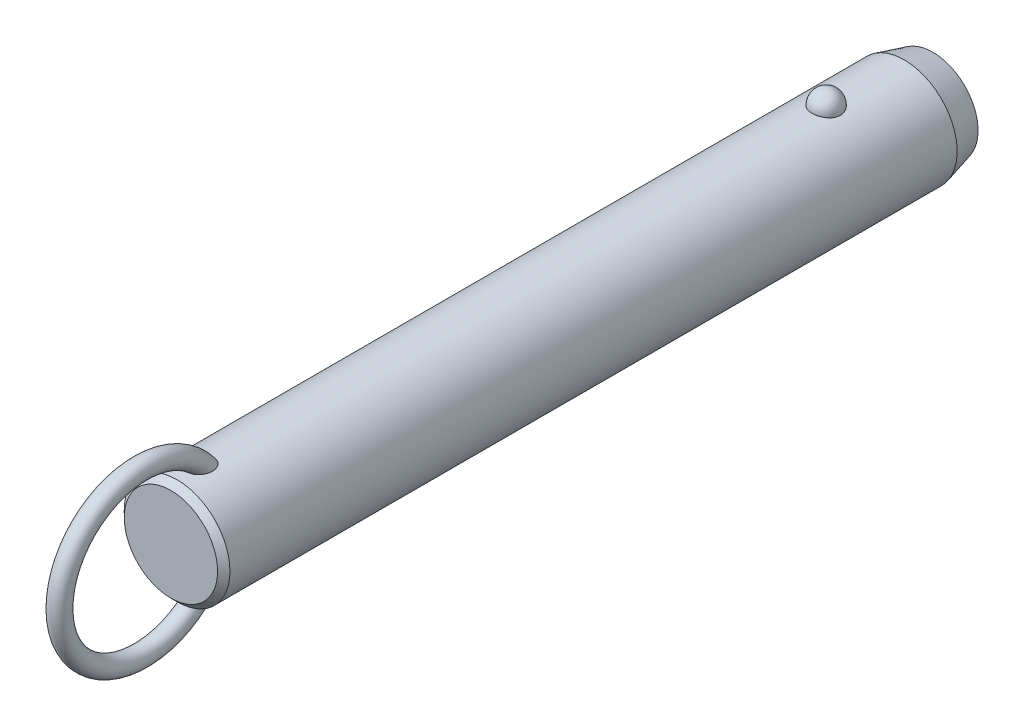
ISO-10303-21;
HEADER;
FILE_DESCRIPTION(('STEP AP214'),'2;1');
FILE_NAME('part.step','',(''),(''),'','','');
FILE_SCHEMA(('AUTOMOTIVE_DESIGN { 1 0 10303 214 1 1 1 1 }'));
ENDSEC;
DATA;
#1=APPLICATION_CONTEXT('core data for automotive mechanical design processes');
#2=APPLICATION_PROTOCOL_DEFINITION('international standard','automotive_design',2000,#1);
#3=PRODUCT_CONTEXT('',#1,'mechanical');
#4=PRODUCT('Part','Part','',(#3));
#5=PRODUCT_RELATED_PRODUCT_CATEGORY('part','',(#4));
#6=PRODUCT_DEFINITION_FORMATION('','',#4);
#7=PRODUCT_DEFINITION_CONTEXT('part definition',#1,'design');
#8=PRODUCT_DEFINITION('design','',#6,#7);
#9=PRODUCT_DEFINITION_SHAPE('','',#8);
#10=(LENGTH_UNIT() NAMED_UNIT(*) SI_UNIT(.MILLI.,.METRE.));
#11=(NAMED_UNIT(*) PLANE_ANGLE_UNIT() SI_UNIT($,.RADIAN.));
#12=(NAMED_UNIT(*) SI_UNIT($,.STERADIAN.) SOLID_ANGLE_UNIT());
#13=UNCERTAINTY_MEASURE_WITH_UNIT(LENGTH_MEASURE(1.E-05),#10,'distance_accuracy_value','');
#14=(GEOMETRIC_REPRESENTATION_CONTEXT(3) GLOBAL_UNCERTAINTY_ASSIGNED_CONTEXT((#13)) GLOBAL_UNIT_ASSIGNED_CONTEXT((#10,
#11,#12)) REPRESENTATION_CONTEXT('',''));
#15=CARTESIAN_POINT('',(0.,0.,0.));
#16=DIRECTION('',(0.,0.,1.));
#17=DIRECTION('',(1.,0.,0.));
#18=AXIS2_PLACEMENT_3D('',#15,#16,#17);
#19=CARTESIAN_POINT('',(0.,0.,121.9));
#20=DIRECTION('',(0.,0.,-1.));
#21=DIRECTION('',(-1.,0.,0.));
#22=AXIS2_PLACEMENT_3D('',#19,#20,#21);
#23=CYLINDRICAL_SURFACE('',#22,11.1);
#24=CARTESIAN_POINT('',(2.9724815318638,10.6945945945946,-3.));
#25=CARTESIAN_POINT('',(2.97247830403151,10.6945972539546,-2.83225059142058));
#26=CARTESIAN_POINT('',(2.95876598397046,10.6984356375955,-2.66445972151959));
#27=CARTESIAN_POINT('',(2.90424529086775,10.7133624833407,-2.33362381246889));
#28=CARTESIAN_POINT('',(2.8634252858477,10.7244540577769,-2.1705808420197));
#29=CARTESIAN_POINT('',(2.75573657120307,10.7526272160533,-1.85396767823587));
#30=CARTESIAN_POINT('',(2.68887937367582,10.7697061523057,-1.70039333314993));
#31=CARTESIAN_POINT('',(2.53079696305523,10.8079438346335,-1.40691598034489));
#32=CARTESIAN_POINT('',(2.43957264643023,10.8291024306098,-1.2670124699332));
#33=CARTESIAN_POINT('',(2.23458150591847,10.8732541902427,-1.00409565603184));
#34=CARTESIAN_POINT('',(2.12071295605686,10.8962553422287,-0.881162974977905));
#35=CARTESIAN_POINT('',(1.87365402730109,10.9414421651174,-0.656352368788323));
#36=CARTESIAN_POINT('',(1.74046358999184,10.9636278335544,-0.554474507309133));
#37=CARTESIAN_POINT('',(1.45872188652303,11.0046495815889,-0.374872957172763));
#38=CARTESIAN_POINT('',(1.31021276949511,11.0234944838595,-0.297085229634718));
#39=CARTESIAN_POINT('',(1.00170030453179,11.0557957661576,-0.167529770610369));
#40=CARTESIAN_POINT('',(0.841698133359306,11.0692526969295,-0.115759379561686));
#41=CARTESIAN_POINT('',(0.517607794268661,11.0890932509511,-0.0403925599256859));
#42=CARTESIAN_POINT('',(0.353633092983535,11.0955916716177,-0.0163383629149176));
#43=CARTESIAN_POINT('',(0.0238420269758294,11.1011989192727,0.0044517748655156));
#44=CARTESIAN_POINT('',(-0.141974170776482,11.1003084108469,0.00119017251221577));
#45=CARTESIAN_POINT('',(-0.468405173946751,11.0912990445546,-0.0323233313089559));
#46=CARTESIAN_POINT('',(-0.629059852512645,11.0832767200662,-0.0622147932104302));
#47=CARTESIAN_POINT('',(-0.942937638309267,11.0609962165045,-0.147645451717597));
#48=CARTESIAN_POINT('',(-1.09616062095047,11.0467379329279,-0.203185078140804));
#49=CARTESIAN_POINT('',(-1.39181061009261,11.0134071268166,-0.3387529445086));
#50=CARTESIAN_POINT('',(-1.53417383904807,10.9943086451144,-0.418913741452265));
#51=CARTESIAN_POINT('',(-1.80342160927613,10.9533667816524,-0.60144882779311));
#52=CARTESIAN_POINT('',(-1.9303046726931,10.9315231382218,-0.703825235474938));
#53=CARTESIAN_POINT('',(-2.16747598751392,10.887005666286,-0.930091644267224));
#54=CARTESIAN_POINT('',(-2.27742774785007,10.8643239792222,-1.05433291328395));
#55=CARTESIAN_POINT('',(-2.47517316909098,10.8209886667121,-1.31966633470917));
#56=CARTESIAN_POINT('',(-2.56296538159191,10.8003351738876,-1.46075958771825));
#57=CARTESIAN_POINT('',(-2.71500300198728,10.7631304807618,-1.75753646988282));
#58=CARTESIAN_POINT('',(-2.77898901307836,10.7466250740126,-1.91335887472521));
#59=CARTESIAN_POINT('',(-2.88046189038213,10.7198747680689,-2.2339152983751));
#60=CARTESIAN_POINT('',(-2.91794947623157,10.709629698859,-2.39864907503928));
#61=CARTESIAN_POINT('',(-2.96537819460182,10.6965949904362,-2.73165170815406));
#62=CARTESIAN_POINT('',(-2.97542891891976,10.693775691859,-2.89990378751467));
#63=CARTESIAN_POINT('',(-2.96804271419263,10.6958279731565,-3.235752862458));
#64=CARTESIAN_POINT('',(-2.95060646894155,10.7006993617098,-3.40334987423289));
#65=CARTESIAN_POINT('',(-2.88883358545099,10.71753912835,-3.73233906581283));
#66=CARTESIAN_POINT('',(-2.84462026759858,10.7294749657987,-3.89375610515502));
#67=CARTESIAN_POINT('',(-2.73050447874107,10.7590797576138,-4.20667949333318));
#68=CARTESIAN_POINT('',(-2.66060103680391,10.7767489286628,-4.35818546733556));
#69=CARTESIAN_POINT('',(-2.49642559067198,10.8159599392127,-4.6478542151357));
#70=CARTESIAN_POINT('',(-2.40203047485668,10.8375211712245,-4.78594458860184));
#71=CARTESIAN_POINT('',(-2.19143488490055,10.8820570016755,-5.0441038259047));
#72=CARTESIAN_POINT('',(-2.07523364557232,10.9050316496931,-5.16417205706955));
#73=CARTESIAN_POINT('',(-1.82361254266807,10.9499219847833,-5.38334833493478));
#74=CARTESIAN_POINT('',(-1.68812945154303,10.9718338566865,-5.48238464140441));
#75=CARTESIAN_POINT('',(-1.40191298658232,11.0120611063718,-5.65618873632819));
#76=CARTESIAN_POINT('',(-1.25118062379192,11.0303767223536,-5.73095813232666));
#77=CARTESIAN_POINT('',(-0.940570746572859,11.0611653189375,-5.85334725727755));
#78=CARTESIAN_POINT('',(-0.780821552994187,11.0737044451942,-5.90127578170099));
#79=CARTESIAN_POINT('',(-0.455204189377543,11.0918598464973,-5.96992976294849));
#80=CARTESIAN_POINT('',(-0.289336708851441,11.0974768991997,-5.99065827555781));
#81=CARTESIAN_POINT('',(0.0406846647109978,11.1011307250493,-6.00418773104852));
#82=CARTESIAN_POINT('',(0.204817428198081,11.099299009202,-5.99747318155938));
#83=CARTESIAN_POINT('',(0.5295530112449,11.088551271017,-5.9574031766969));
#84=CARTESIAN_POINT('',(0.69015594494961,11.0796354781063,-5.92404858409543));
#85=CARTESIAN_POINT('',(1.0027760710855,11.0557204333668,-5.83180084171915));
#86=CARTESIAN_POINT('',(1.15482001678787,11.0407414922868,-5.77299291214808));
#87=CARTESIAN_POINT('',(1.44678373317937,11.0062913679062,-5.63147366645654));
#88=CARTESIAN_POINT('',(1.58670279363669,10.9868199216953,-5.54876095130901));
#89=CARTESIAN_POINT('',(1.8527023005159,10.9451315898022,-5.36027644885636));
#90=CARTESIAN_POINT('',(1.97855158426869,10.9228788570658,-5.25418644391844));
#91=CARTESIAN_POINT('',(2.21080872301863,10.8782509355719,-5.02251354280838));
#92=CARTESIAN_POINT('',(2.31721312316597,10.8558757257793,-4.89692718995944));
#93=CARTESIAN_POINT('',(2.5094551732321,10.8130715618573,-4.62745408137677));
#94=CARTESIAN_POINT('',(2.59493284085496,10.7926798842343,-4.48330448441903));
#95=CARTESIAN_POINT('',(2.740862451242,10.7565495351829,-4.18236358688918));
#96=CARTESIAN_POINT('',(2.80132490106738,10.7408089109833,-4.02557762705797));
#97=CARTESIAN_POINT('',(2.88959070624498,10.7173718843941,-3.72475308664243));
#98=CARTESIAN_POINT('',(2.92062102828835,10.7088950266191,-3.58171216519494));
#99=CARTESIAN_POINT('',(2.96206765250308,10.6975052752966,-3.29245795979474));
#100=CARTESIAN_POINT('',(2.97248434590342,10.6945922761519,-3.14624473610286));
#101=CARTESIAN_POINT('',(2.9724815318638,10.6945945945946,-3.));
#102=B_SPLINE_CURVE_WITH_KNOTS('',3,(#24,#25,#26,#27,#28,#29,#30,#31,#32,#33,#34,#35,#36,#37,
#38,#39,#40,#41,#42,#43,#44,#45,#46,#47,#48,#49,#50,#51,#52,#53,#54,#55,#56,#57,#58,#59,#60,#61,
#62,#63,#64,#65,#66,#67,#68,#69,#70,#71,#72,#73,#74,#75,#76,#77,#78,#79,#80,#81,#82,#83,#84,#85,
#86,#87,#88,#89,#90,#91,#92,#93,#94,#95,#96,#97,#98,#99,#100,#101),.UNSPECIFIED.,.T.,.F.,(4,2,2,
2,2,2,2,2,2,2,2,2,2,2,2,2,2,2,2,2,2,2,2,2,2,2,2,2,2,2,2,2,2,2,2,2,2,2,4),(0.,0.502722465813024,
1.00566079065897,1.5083769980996,2.01107471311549,2.51608392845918,3.02109467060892,
3.52475118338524,4.02835620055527,4.523518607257,5.0186364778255,5.50715297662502,
5.9956776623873,6.48688002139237,6.97812923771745,7.47814366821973,7.9781907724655,
8.48353712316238,8.9888697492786,9.49218093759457,9.99547960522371,10.4964777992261,
10.997494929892,11.5010810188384,12.0046847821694,12.5099796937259,13.0152411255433,
13.5145635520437,14.0138298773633,14.5043200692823,14.9947943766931,15.4836390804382,
15.9725123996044,16.4685040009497,16.9645836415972,17.4686765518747,17.972557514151,
18.410841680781,18.849117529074),.UNSPECIFIED.);
#103=CARTESIAN_POINT('',(2.9724815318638,10.6945945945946,-3.));
#104=VERTEX_POINT('',#103);
#105=EDGE_CURVE('E41',#104,#104,#102,.T.);
#106=ORIENTED_EDGE('',*,*,#105,.T.);
#107=EDGE_LOOP('',(#106));
#108=FACE_BOUND('',#107,.T.);
#109=CARTESIAN_POINT('',(0.,0.,133.3));
#110=DIRECTION('',(0.,0.,1.));
#111=DIRECTION('',(1.,0.,0.));
#112=AXIS2_PLACEMENT_3D('',#109,#110,#111);
#113=CIRCLE('',#112,11.1);
#114=CARTESIAN_POINT('',(11.1,0.,133.3));
#115=VERTEX_POINT('',#114);
#116=EDGE_CURVE('E10',#115,#115,#113,.F.);
#117=ORIENTED_EDGE('',*,*,#116,.T.);
#118=EDGE_LOOP('',(#117));
#119=FACE_BOUND('',#118,.T.);
#120=CARTESIAN_POINT('',(-0.564520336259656,-11.0856356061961,125.557815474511));
#121=CARTESIAN_POINT('',(-0.667202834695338,-11.0804062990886,125.591283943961));
#122=CARTESIAN_POINT('',(-0.766875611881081,-11.0738877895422,125.633835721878));
#123=CARTESIAN_POINT('',(-0.957284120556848,-11.0590576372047,125.735419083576));
#124=CARTESIAN_POINT('',(-1.04801616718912,-11.0507452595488,125.79445742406));
#125=CARTESIAN_POINT('',(-1.21800952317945,-11.0333016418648,125.926529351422));
#126=CARTESIAN_POINT('',(-1.29730805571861,-11.0241732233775,125.999515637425));
#127=CARTESIAN_POINT('',(-1.44337665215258,-11.0060026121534,126.157037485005));
#128=CARTESIAN_POINT('',(-1.51014622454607,-10.9969604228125,126.241573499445));
#129=CARTESIAN_POINT('',(-1.63454620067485,-10.9791841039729,126.425521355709));
#130=CARTESIAN_POINT('',(-1.69127003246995,-10.9705107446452,126.525549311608));
#131=CARTESIAN_POINT('',(-1.78980785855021,-10.9548648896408,126.732790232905));
#132=CARTESIAN_POINT('',(-1.83161214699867,-10.9478935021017,126.840007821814));
#133=CARTESIAN_POINT('',(-1.91557028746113,-10.9335803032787,127.105408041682));
#134=CARTESIAN_POINT('',(-1.95040620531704,-10.9273269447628,127.265980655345));
#135=CARTESIAN_POINT('',(-1.99388326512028,-10.9194709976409,127.590697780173));
#136=CARTESIAN_POINT('',(-2.00248051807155,-10.9178762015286,127.754847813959));
#137=CARTESIAN_POINT('',(-1.99551615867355,-10.9191578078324,128.124650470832));
#138=CARTESIAN_POINT('',(-1.9732206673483,-10.9232807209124,128.330191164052));
#139=CARTESIAN_POINT('',(-1.9152976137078,-10.9335244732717,128.633595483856));
#140=CARTESIAN_POINT('',(-1.89184575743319,-10.9376266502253,128.734088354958));
#141=CARTESIAN_POINT('',(-1.83700674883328,-10.9469720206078,128.932855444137));
#142=CARTESIAN_POINT('',(-1.80562070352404,-10.9522150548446,129.031129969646));
#143=CARTESIAN_POINT('',(-1.73463055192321,-10.9636837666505,129.225914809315));
#144=CARTESIAN_POINT('',(-1.69493416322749,-10.9699202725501,129.322390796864));
#145=CARTESIAN_POINT('',(-1.60745141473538,-10.9830806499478,129.511626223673));
#146=CARTESIAN_POINT('',(-1.55966150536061,-10.9900048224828,129.604384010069));
#147=CARTESIAN_POINT('',(-1.45591812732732,-11.0042280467,129.784690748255));
#148=CARTESIAN_POINT('',(-1.4000001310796,-11.0115253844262,129.872260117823));
#149=CARTESIAN_POINT('',(-1.27937470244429,-11.0261911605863,130.041029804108));
#150=CARTESIAN_POINT('',(-1.2146783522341,-11.0335594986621,130.12223795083));
#151=CARTESIAN_POINT('',(-1.08218150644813,-11.0473027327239,130.269001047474));
#152=CARTESIAN_POINT('',(-1.01522633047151,-11.0537063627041,130.335309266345));
#153=CARTESIAN_POINT('',(-0.872952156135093,-11.065850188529,130.458378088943));
#154=CARTESIAN_POINT('',(-0.797642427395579,-11.0715911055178,130.515149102));
#155=CARTESIAN_POINT('',(-0.651396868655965,-11.081071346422,130.607515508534));
#156=CARTESIAN_POINT('',(-0.581712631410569,-11.0849841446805,130.645049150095));
#157=CARTESIAN_POINT('',(-0.437066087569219,-11.0916271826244,130.708259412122));
#158=CARTESIAN_POINT('',(-0.362109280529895,-11.0943586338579,130.733948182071));
#159=CARTESIAN_POINT('',(-0.207828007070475,-11.0983242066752,130.771117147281));
#160=CARTESIAN_POINT('',(-0.128467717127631,-11.0995432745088,130.782454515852));
#161=CARTESIAN_POINT('',(0.0309101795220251,-11.1002423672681,130.788965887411));
#162=CARTESIAN_POINT('',(0.110927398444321,-11.0997233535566,130.784148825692));
#163=CARTESIAN_POINT('',(0.256406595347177,-11.097240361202,130.760959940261));
#164=CARTESIAN_POINT('',(0.322235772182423,-11.0955074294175,130.744754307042));
#165=CARTESIAN_POINT('',(0.450635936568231,-11.0910350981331,130.702600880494));
#166=CARTESIAN_POINT('',(0.513205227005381,-11.0882951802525,130.676648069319));
#167=CARTESIAN_POINT('',(0.662626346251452,-11.0805620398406,130.602607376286));
#168=CARTESIAN_POINT('',(0.747127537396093,-11.0751144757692,130.549845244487));
#169=CARTESIAN_POINT('',(0.906756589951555,-11.0631932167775,130.431720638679));
#170=CARTESIAN_POINT('',(0.981859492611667,-11.0567168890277,130.366325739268));
#171=CARTESIAN_POINT('',(1.10712207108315,-11.0447856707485,130.24226337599));
#172=CARTESIAN_POINT('',(1.15909566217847,-11.0394280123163,130.185383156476));
#173=CARTESIAN_POINT('',(1.25791923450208,-11.0286040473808,130.067327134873));
#174=CARTESIAN_POINT('',(1.30476642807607,-11.0231376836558,130.006149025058));
#175=CARTESIAN_POINT('',(1.43818612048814,-11.0068027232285,129.817305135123));
#176=CARTESIAN_POINT('',(1.51751767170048,-10.9960104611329,129.684453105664));
#177=CARTESIAN_POINT('',(1.63597546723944,-10.9788847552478,129.453137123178));
#178=CARTESIAN_POINT('',(1.67988876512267,-10.9722190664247,129.357053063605));
#179=CARTESIAN_POINT('',(1.75953241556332,-10.9597298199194,129.161431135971));
#180=CARTESIAN_POINT('',(1.7952596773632,-10.9539065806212,129.061891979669));
#181=CARTESIAN_POINT('',(1.85844731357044,-10.9433632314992,128.86021118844));
#182=CARTESIAN_POINT('',(1.88591073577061,-10.9386427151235,128.75807052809));
#183=CARTESIAN_POINT('',(1.93234324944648,-10.9305350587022,128.551819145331));
#184=CARTESIAN_POINT('',(1.95131065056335,-10.9271481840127,128.447708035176));
#185=CARTESIAN_POINT('',(1.99040203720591,-10.9201183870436,128.165458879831));
#186=CARTESIAN_POINT('',(2.00221217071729,-10.9179256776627,127.986037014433));
#187=CARTESIAN_POINT('',(1.99711676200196,-10.9188636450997,127.627713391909));
#188=CARTESIAN_POINT('',(1.98026150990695,-10.9219849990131,127.448811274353));
#189=CARTESIAN_POINT('',(1.92151657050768,-10.9324473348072,127.13645144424));
#190=CARTESIAN_POINT('',(1.88605081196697,-10.9386915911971,127.001759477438));
#191=CARTESIAN_POINT('',(1.79393020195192,-10.9541780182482,126.739966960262));
#192=CARTESIAN_POINT('',(1.73729868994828,-10.9634168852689,126.612858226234));
#193=CARTESIAN_POINT('',(1.61237037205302,-10.9824218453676,126.389418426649));
#194=CARTESIAN_POINT('',(1.5471537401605,-10.9918945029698,126.291345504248));
#195=CARTESIAN_POINT('',(1.40127026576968,-11.0114415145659,126.107434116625));
#196=CARTESIAN_POINT('',(1.32060742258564,-11.0215157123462,126.021592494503));
#197=CARTESIAN_POINT('',(1.14474787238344,-11.041168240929,125.865163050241));
#198=CARTESIAN_POINT('',(1.04947805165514,-11.0507437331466,125.794656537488));
#199=CARTESIAN_POINT('',(0.84727806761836,-11.0680789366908,125.672640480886));
#200=CARTESIAN_POINT('',(0.740351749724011,-11.0758392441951,125.621124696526));
#201=CARTESIAN_POINT('',(0.529289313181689,-11.0878275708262,125.543485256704));
#202=CARTESIAN_POINT('',(0.425895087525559,-11.0923259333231,125.515377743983));
#203=CARTESIAN_POINT('',(0.215723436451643,-11.0984001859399,125.477703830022));
#204=CARTESIAN_POINT('',(0.108947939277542,-11.0999777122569,125.468127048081));
#205=CARTESIAN_POINT('',(-0.0938962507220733,-11.1000196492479,125.467877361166));
#206=CARTESIAN_POINT('',(-0.189967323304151,-11.0987797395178,125.475408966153));
#207=CARTESIAN_POINT('',(-0.379657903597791,-11.0939111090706,125.505507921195));
#208=CARTESIAN_POINT('',(-0.473277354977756,-11.0902823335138,125.528075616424));
#209=CARTESIAN_POINT('',(-0.564520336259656,-11.0856356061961,125.557815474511));
#210=B_SPLINE_CURVE_WITH_KNOTS('',3,(#120,#121,#122,#123,#124,#125,#126,#127,#128,#129,#130,
#131,#132,#133,#134,#135,#136,#137,#138,#139,#140,#141,#142,#143,#144,#145,#146,#147,#148,#149,
#150,#151,#152,#153,#154,#155,#156,#157,#158,#159,#160,#161,#162,#163,#164,#165,#166,#167,#168,
#169,#170,#171,#172,#173,#174,#175,#176,#177,#178,#179,#180,#181,#182,#183,#184,#185,#186,#187,
#188,#189,#190,#191,#192,#193,#194,#195,#196,#197,#198,#199,#200,#201,#202,#203,#204,#205,#206,
#207,#208,#209),.UNSPECIFIED.,.T.,.F.,(4,2,2,2,2,2,2,2,2,2,2,2,2,2,2,2,2,2,2,2,2,2,2,2,2,2,2,2,
2,2,2,2,2,2,2,2,2,2,2,2,2,2,2,2,4),(0.,0.323999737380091,0.648132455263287,0.971184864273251,
1.29424994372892,1.63886237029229,1.98369857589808,2.47426059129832,2.96564271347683,
3.58257396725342,3.89215258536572,4.20168803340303,4.51486273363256,4.82817514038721,
5.14015911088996,5.45175282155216,5.734428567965,6.01679375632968,6.25364580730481,
6.49025437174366,6.7291996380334,6.96801276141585,7.17061258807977,7.37331685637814,
7.67094989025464,7.96935728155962,8.2007506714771,8.43226927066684,8.89581623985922,
9.21306533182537,9.53043400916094,9.8476854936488,10.1650000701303,10.7022930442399,
11.2386443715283,11.655339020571,12.071575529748,12.4245637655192,12.7774607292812,
13.1321855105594,13.4867936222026,13.8068771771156,14.1267813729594,14.4146787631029,
14.7025827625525),.UNSPECIFIED.);
#211=CARTESIAN_POINT('',(-0.564520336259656,-11.0856356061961,125.557815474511));
#212=VERTEX_POINT('',#211);
#213=EDGE_CURVE('E60',#212,#212,#210,.T.);
#214=ORIENTED_EDGE('',*,*,#213,.T.);
#215=EDGE_LOOP('',(#214));
#216=FACE_BOUND('',#215,.T.);
#217=CARTESIAN_POINT('',(-0.564520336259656,11.0856356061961,125.557815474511));
#218=CARTESIAN_POINT('',(-0.468542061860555,11.0905203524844,125.526545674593));
#219=CARTESIAN_POINT('',(-0.369793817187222,11.0942886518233,125.503157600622));
#220=CARTESIAN_POINT('',(-0.169555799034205,11.0991586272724,125.473085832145));
#221=CARTESIAN_POINT('',(-0.0680604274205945,11.1002543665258,125.46643932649));
#222=CARTESIAN_POINT('',(0.13454973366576,11.099646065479,125.470157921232));
#223=CARTESIAN_POINT('',(0.235664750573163,11.0979441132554,125.48051033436));
#224=CARTESIAN_POINT('',(0.434632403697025,11.0919342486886,125.517831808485));
#225=CARTESIAN_POINT('',(0.532486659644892,11.0876276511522,125.544792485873));
#226=CARTESIAN_POINT('',(0.722445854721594,11.0768742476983,125.6144096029));
#227=CARTESIAN_POINT('',(0.814543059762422,11.0704246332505,125.657086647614));
#228=CARTESIAN_POINT('',(0.990565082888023,11.0560659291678,125.756648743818));
#229=CARTESIAN_POINT('',(1.07448844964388,11.048156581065,125.813536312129));
#230=CARTESIAN_POINT('',(1.23562672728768,11.0313221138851,125.942210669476));
#231=CARTESIAN_POINT('',(1.31242684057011,11.0223686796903,126.014511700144));
#232=CARTESIAN_POINT('',(1.45398030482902,11.0045918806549,126.170042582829));
#233=CARTESIAN_POINT('',(1.51873073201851,10.9957685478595,126.253275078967));
#234=CARTESIAN_POINT('',(1.64107232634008,10.9782087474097,126.436384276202));
#235=CARTESIAN_POINT('',(1.69743176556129,10.9695572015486,126.537089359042));
#236=CARTESIAN_POINT('',(1.79515063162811,10.9539887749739,126.745626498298));
#237=CARTESIAN_POINT('',(1.83649966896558,10.9470730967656,126.85346343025));
#238=CARTESIAN_POINT('',(1.91931148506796,10.9329211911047,127.120399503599));
#239=CARTESIAN_POINT('',(1.9534010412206,10.9267904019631,127.281861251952));
#240=CARTESIAN_POINT('',(1.99526195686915,10.9192174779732,127.60821631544));
#241=CARTESIAN_POINT('',(2.00298989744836,10.9177830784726,127.77311484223));
#242=CARTESIAN_POINT('',(1.99396251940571,10.9194420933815,128.144100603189));
#243=CARTESIAN_POINT('',(1.97050829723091,10.923774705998,128.35003871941));
#244=CARTESIAN_POINT('',(1.91079643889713,10.9343131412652,128.653901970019));
#245=CARTESIAN_POINT('',(1.8867370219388,10.9385106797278,128.754529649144));
#246=CARTESIAN_POINT('',(1.83065508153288,10.9480376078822,128.953510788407));
#247=CARTESIAN_POINT('',(1.79863369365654,10.9533668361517,129.051864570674));
#248=CARTESIAN_POINT('',(1.72633365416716,10.9649954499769,129.246720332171));
#249=CARTESIAN_POINT('',(1.68596409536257,10.9713053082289,129.34318790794));
#250=CARTESIAN_POINT('',(1.5970799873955,10.9845964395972,129.532323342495));
#251=CARTESIAN_POINT('',(1.54856169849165,10.9915780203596,129.624989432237));
#252=CARTESIAN_POINT('',(1.44330168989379,11.0058935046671,129.804975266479));
#253=CARTESIAN_POINT('',(1.38659749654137,11.0132257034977,129.892316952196));
#254=CARTESIAN_POINT('',(1.26431158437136,11.0279330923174,130.060456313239));
#255=CARTESIAN_POINT('',(1.19874160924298,11.0353082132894,130.141262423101));
#256=CARTESIAN_POINT('',(1.06542088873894,11.048931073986,130.285985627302));
#257=CARTESIAN_POINT('',(0.998640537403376,11.0552153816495,130.350784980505));
#258=CARTESIAN_POINT('',(0.856896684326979,11.0671032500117,130.470846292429));
#259=CARTESIAN_POINT('',(0.781942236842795,11.0727075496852,130.526118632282));
#260=CARTESIAN_POINT('',(0.63627641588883,11.081949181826,130.615972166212));
#261=CARTESIAN_POINT('',(0.566755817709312,11.0857572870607,130.652441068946));
#262=CARTESIAN_POINT('',(0.422602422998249,11.0921860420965,130.713533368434));
#263=CARTESIAN_POINT('',(0.347974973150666,11.0948079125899,130.738168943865));
#264=CARTESIAN_POINT('',(0.194593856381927,11.0985608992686,130.773323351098));
#265=CARTESIAN_POINT('',(0.115807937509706,11.0996777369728,130.783706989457));
#266=CARTESIAN_POINT('',(-0.0422499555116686,11.1002003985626,130.788574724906));
#267=CARTESIAN_POINT('',(-0.121521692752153,11.09960699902,130.783066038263));
#268=CARTESIAN_POINT('',(-0.266046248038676,11.0970123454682,130.758827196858));
#269=CARTESIAN_POINT('',(-0.331661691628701,11.0952283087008,130.742135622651));
#270=CARTESIAN_POINT('',(-0.45958809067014,11.0906663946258,130.699111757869));
#271=CARTESIAN_POINT('',(-0.521897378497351,11.0878880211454,130.672774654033));
#272=CARTESIAN_POINT('',(-0.671446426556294,11.0800342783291,130.597513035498));
#273=CARTESIAN_POINT('',(-0.756250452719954,11.0744969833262,130.543818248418));
#274=CARTESIAN_POINT('',(-0.916349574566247,11.0624045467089,130.423802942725));
#275=CARTESIAN_POINT('',(-0.991618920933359,11.0558467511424,130.357449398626));
#276=CARTESIAN_POINT('',(-1.11713140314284,11.0437783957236,130.231633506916));
#277=CARTESIAN_POINT('',(-1.16920539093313,11.0383619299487,130.173952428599));
#278=CARTESIAN_POINT('',(-1.26817476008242,11.02743010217,130.054280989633));
#279=CARTESIAN_POINT('',(-1.315067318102,11.0219146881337,129.992288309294));
#280=CARTESIAN_POINT('',(-1.40399813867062,11.0109399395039,129.864784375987));
#281=CARTESIAN_POINT('',(-1.44602864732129,11.0054807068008,129.799267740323));
#282=CARTESIAN_POINT('',(-1.52538779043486,10.9947621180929,129.665422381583));
#283=CARTESIAN_POINT('',(-1.56271516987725,10.9895028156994,129.597092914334));
#284=CARTESIAN_POINT('',(-1.64537943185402,10.9774790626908,129.433210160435));
#285=CARTESIAN_POINT('',(-1.68879497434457,10.9708503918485,129.3366735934));
#286=CARTESIAN_POINT('',(-1.76740738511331,10.9584602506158,129.140236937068));
#287=CARTESIAN_POINT('',(-1.80260120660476,10.95269910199,129.04033561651));
#288=CARTESIAN_POINT('',(-1.86468657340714,10.9423003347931,128.837966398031));
#289=CARTESIAN_POINT('',(-1.8915816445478,10.9376622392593,128.735499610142));
#290=CARTESIAN_POINT('',(-1.93682458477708,10.9297405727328,128.528642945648));
#291=CARTESIAN_POINT('',(-1.95517082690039,10.9264572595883,128.424252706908));
#292=CARTESIAN_POINT('',(-1.99232562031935,10.9197647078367,128.14262876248));
#293=CARTESIAN_POINT('',(-2.00294603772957,10.9177914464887,127.964185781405));
#294=CARTESIAN_POINT('',(-1.99566675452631,10.9191290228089,127.607996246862));
#295=CARTESIAN_POINT('',(-1.97781651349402,10.9224306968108,127.43024902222));
#296=CARTESIAN_POINT('',(-1.91747214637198,10.9331592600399,127.119792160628));
#297=CARTESIAN_POINT('',(-1.88131022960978,10.9395108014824,126.985825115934));
#298=CARTESIAN_POINT('',(-1.78790380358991,10.9551659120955,126.72559757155));
#299=CARTESIAN_POINT('',(-1.73068309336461,10.9644661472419,126.599328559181));
#300=CARTESIAN_POINT('',(-1.60475573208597,10.9835398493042,126.37741565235));
#301=CARTESIAN_POINT('',(-1.53908879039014,10.9930297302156,126.280026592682));
#302=CARTESIAN_POINT('',(-1.39238608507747,11.0125708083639,126.097525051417));
#303=CARTESIAN_POINT('',(-1.31135150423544,11.0226219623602,126.012411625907));
#304=CARTESIAN_POINT('',(-1.14382035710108,11.0411991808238,125.86529943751));
#305=CARTESIAN_POINT('',(-1.05858500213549,11.0497792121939,125.80186930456));
#306=CARTESIAN_POINT('',(-0.878723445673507,11.0655285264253,125.690250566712));
#307=CARTESIAN_POINT('',(-0.784123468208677,11.0727015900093,125.642020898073));
#308=CARTESIAN_POINT('',(-0.646163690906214,11.0812501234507,125.586023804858));
#309=CARTESIAN_POINT('',(-0.605595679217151,11.0835451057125,125.571197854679));
#310=CARTESIAN_POINT('',(-0.564520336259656,11.0856356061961,125.557815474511));
#311=B_SPLINE_CURVE_WITH_KNOTS('',3,(#217,#218,#219,#220,#221,#222,#223,#224,#225,#226,#227,
#228,#229,#230,#231,#232,#233,#234,#235,#236,#237,#238,#239,#240,#241,#242,#243,#244,#245,#246,
#247,#248,#249,#250,#251,#252,#253,#254,#255,#256,#257,#258,#259,#260,#261,#262,#263,#264,#265,
#266,#267,#268,#269,#270,#271,#272,#273,#274,#275,#276,#277,#278,#279,#280,#281,#282,#283,#284,
#285,#286,#287,#288,#289,#290,#291,#292,#293,#294,#295,#296,#297,#298,#299,#300,#301,#302,#303,
#304,#305,#306,#307,#308,#309,#310),.UNSPECIFIED.,.T.,.F.,(4,2,2,2,2,2,2,2,2,2,2,2,2,2,2,2,2,2,
2,2,2,2,2,2,2,2,2,2,2,2,2,2,2,2,2,2,2,2,2,2,2,2,2,2,2,2,4),(0.,0.303061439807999,
0.606795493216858,0.91030295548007,1.21365733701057,1.51741085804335,1.82121821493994,
2.13745205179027,2.45376252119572,2.79958678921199,3.14564996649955,3.63832391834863,
4.13180893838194,4.75031912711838,5.06071926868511,5.37107516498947,5.68500772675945,
5.99908475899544,6.31176519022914,6.62403542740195,6.90315673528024,7.18197194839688,
7.41687778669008,7.65154134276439,7.8884158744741,8.12518286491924,8.32752842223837,
8.52997509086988,8.8298642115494,9.13054668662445,9.36393502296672,9.59744991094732,
9.83133221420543,10.0652767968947,10.383032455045,10.7009056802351,11.0186436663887,
11.3364420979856,11.8705925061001,12.4038159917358,12.8189662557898,13.2336487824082,
13.5857049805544,13.9377340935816,14.2561354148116,14.5736690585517,14.7033687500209),.UNSPECIFIED.);
#312=CARTESIAN_POINT('',(-0.564520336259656,11.0856356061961,125.557815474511));
#313=VERTEX_POINT('',#312);
#314=EDGE_CURVE('E68',#313,#313,#311,.T.);
#315=ORIENTED_EDGE('',*,*,#314,.T.);
#316=EDGE_LOOP('',(#315));
#317=FACE_BOUND('',#316,.T.);
#318=CARTESIAN_POINT('',(0.,0.,-19.3999999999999));
#319=DIRECTION('',(0.,0.,-1.));
#320=DIRECTION('',(-1.,0.,0.));
#321=AXIS2_PLACEMENT_3D('',#318,#319,#320);
#322=CIRCLE('',#321,11.1);
#323=CARTESIAN_POINT('',(-11.1,0.,-19.3999999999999));
#324=VERTEX_POINT('',#323);
#325=EDGE_CURVE('E57',#324,#324,#322,.F.);
#326=ORIENTED_EDGE('',*,*,#325,.T.);
#327=EDGE_LOOP('',(#326));
#328=FACE_BOUND('',#327,.T.);
#329=ADVANCED_FACE('F37',(#108,#119,#216,#317,#328),#23,.T.);
#330=CARTESIAN_POINT('',(0.,0.,-25.4));
#331=DIRECTION('',(0.,0.,-1.));
#332=DIRECTION('',(-1.,0.,0.));
#333=AXIS2_PLACEMENT_3D('',#330,#331,#332);
#334=PLANE('',#333);
#335=CARTESIAN_POINT('',(0.,0.,-25.4));
#336=DIRECTION('',(0.,0.,-1.));
#337=DIRECTION('',(-1.,0.,0.));
#338=AXIS2_PLACEMENT_3D('',#335,#336,#337);
#339=CIRCLE('',#338,9.49230484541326);
#340=CARTESIAN_POINT('',(-9.49230484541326,0.,-25.4));
#341=VERTEX_POINT('',#340);
#342=EDGE_CURVE('E67',#341,#341,#339,.T.);
#343=ORIENTED_EDGE('',*,*,#342,.T.);
#344=EDGE_LOOP('',(#343));
#345=FACE_BOUND('',#344,.T.);
#346=ADVANCED_FACE('F86',(#345),#334,.T.);
#347=CARTESIAN_POINT('',(0.,0.,-25.4));
#348=DIRECTION('',(0.,0.,1.));
#349=DIRECTION('',(1.,0.,0.));
#350=AXIS2_PLACEMENT_3D('',#347,#348,#349);
#351=CONICAL_SURFACE('',#350,9.49230484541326,0.261799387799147);
#352=ORIENTED_EDGE('',*,*,#325,.F.);
#353=EDGE_LOOP('',(#352));
#354=FACE_BOUND('',#353,.T.);
#355=ORIENTED_EDGE('',*,*,#342,.F.);
#356=EDGE_LOOP('',(#355));
#357=FACE_BOUND('',#356,.T.);
#358=ADVANCED_FACE('F84',(#354,#357),#351,.T.);
#359=CARTESIAN_POINT('',(0.,0.,134.6));
#360=DIRECTION('',(0.,0.,1.));
#361=DIRECTION('',(1.,0.,0.));
#362=AXIS2_PLACEMENT_3D('',#359,#360,#361);
#363=PLANE('',#362);
#364=CARTESIAN_POINT('',(0.,0.,134.6));
#365=DIRECTION('',(0.,0.,1.));
#366=DIRECTION('',(1.,0.,0.));
#367=AXIS2_PLACEMENT_3D('',#364,#365,#366);
#368=CIRCLE('',#367,9.8);
#369=CARTESIAN_POINT('',(9.8,0.,134.6));
#370=VERTEX_POINT('',#369);
#371=EDGE_CURVE('E50',#370,#370,#368,.T.);
#372=ORIENTED_EDGE('',*,*,#371,.T.);
#373=EDGE_LOOP('',(#372));
#374=FACE_BOUND('',#373,.T.);
#375=ADVANCED_FACE('F78',(#374),#363,.T.);
#376=CARTESIAN_POINT('',(0.,0.,140.95));
#377=DIRECTION('',(1.,0.,0.));
#378=DIRECTION('',(0.,0.,-1.));
#379=AXIS2_PLACEMENT_3D('',#376,#377,#378);
#380=TOROIDAL_SURFACE('',#379,17.05,2.);
#381=ORIENTED_EDGE('',*,*,#314,.F.);
#382=EDGE_LOOP('',(#381));
#383=FACE_BOUND('',#382,.T.);
#384=ORIENTED_EDGE('',*,*,#213,.F.);
#385=EDGE_LOOP('',(#384));
#386=FACE_BOUND('',#385,.T.);
#387=ADVANCED_FACE('F74',(#383,#386),#380,.T.);
#388=CARTESIAN_POINT('',(0.,0.,134.6));
#389=DIRECTION('',(0.,0.,-1.));
#390=DIRECTION('',(-1.,0.,0.));
#391=AXIS2_PLACEMENT_3D('',#388,#389,#390);
#392=CONICAL_SURFACE('',#391,9.8,0.785398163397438);
#393=ORIENTED_EDGE('',*,*,#116,.F.);
#394=EDGE_LOOP('',(#393));
#395=FACE_BOUND('',#394,.T.);
#396=ORIENTED_EDGE('',*,*,#371,.F.);
#397=EDGE_LOOP('',(#396));
#398=FACE_BOUND('',#397,.T.);
#399=ADVANCED_FACE('F39',(#395,#398),#392,.T.);
#400=CARTESIAN_POINT('',(0.,11.1,-3.));
#401=DIRECTION('',(0.,1.,0.));
#402=DIRECTION('',(0.,0.,-1.));
#403=AXIS2_PLACEMENT_3D('',#400,#401,#402);
#404=SPHERICAL_SURFACE('',#403,3.);
#405=ORIENTED_EDGE('',*,*,#105,.F.);
#406=EDGE_LOOP('',(#405));
#407=FACE_BOUND('',#406,.T.);
#408=ADVANCED_FACE('F80',(#407),#404,.T.);
#409=CLOSED_SHELL('',(#329,#346,#358,#375,#387,#399,#408));
#410=MANIFOLD_SOLID_BREP('B2',#409);
#411=ADVANCED_BREP_SHAPE_REPRESENTATION('',(#18,#410),#14);
#412=SHAPE_DEFINITION_REPRESENTATION(#9,#411);
ENDSEC;
END-ISO-10303-21;
